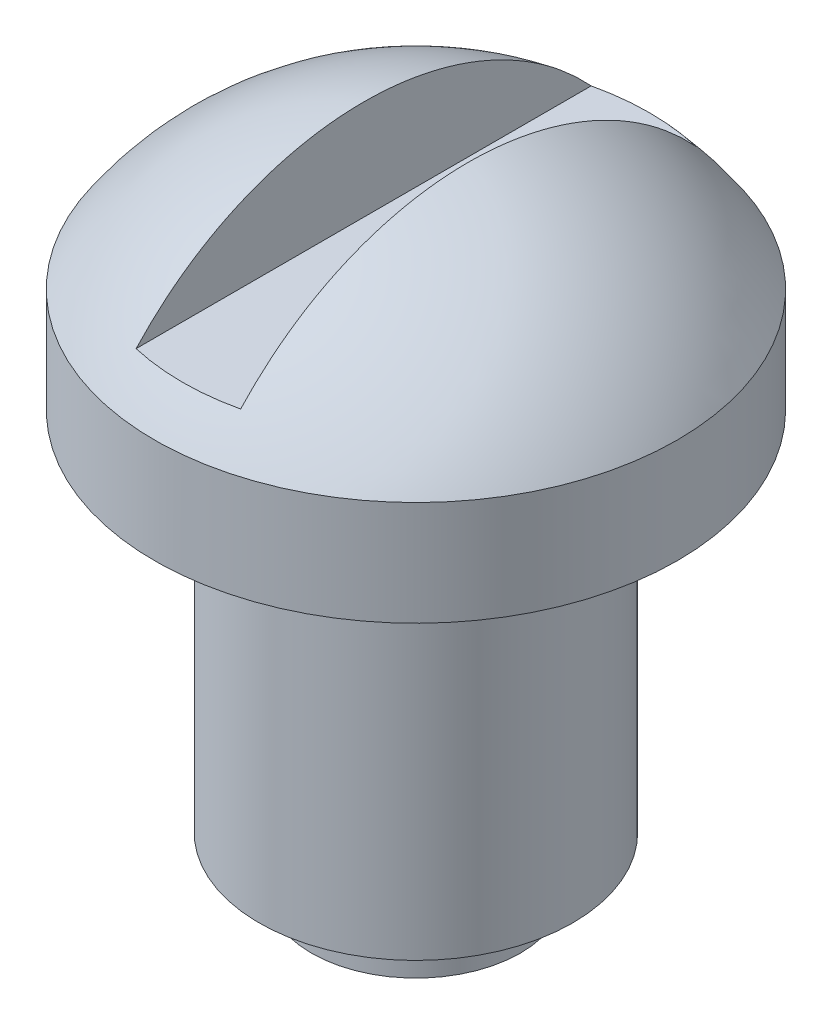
from build123d import *

# Parameters (mm, degrees)
SKETCH2_W      = 2
SKETCH2_H      = 10.7
EXTRUDE1_DEPTH = 2


with BuildPart() as part:
    # Sketch1 → Revolve1 (revolve)
    with BuildSketch(Plane.XY, mode=Mode.PRIVATE) as revolve1_sk:
        with BuildLine():
            Line((0, 0), (-2, 0))
            Line((-2, 0), (-2, 1))
            Line((-2, 1), (-3, 1))
            Line((-3, 1), (-3, 8))
            Line((-3, 8), (-5, 8))
            Line((-5, 8), (-5, 10))
            ThreePointArc((-5, 10), (-2.837274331, 11.970139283), (0, 12.68337521))
            Line((0, 12.68337521), (0, 0))
        make_face()
    revolve(revolve1_sk.sketch.rotate(Axis((0, 0, 0), (0, 1, 0)), 180), axis=Axis((0, 0, 0), (0, 1, 0)))

    # Sketch2 → Extrude1 (cut)
    with BuildSketch(Plane(origin=(0, 12.69, 0), x_dir=(-1, 0, 0), z_dir=(0, 1, 0))):
        Rectangle(SKETCH2_W, SKETCH2_H)
    extrude(amount=-EXTRUDE1_DEPTH, mode=Mode.SUBTRACT)


solid = part.part
